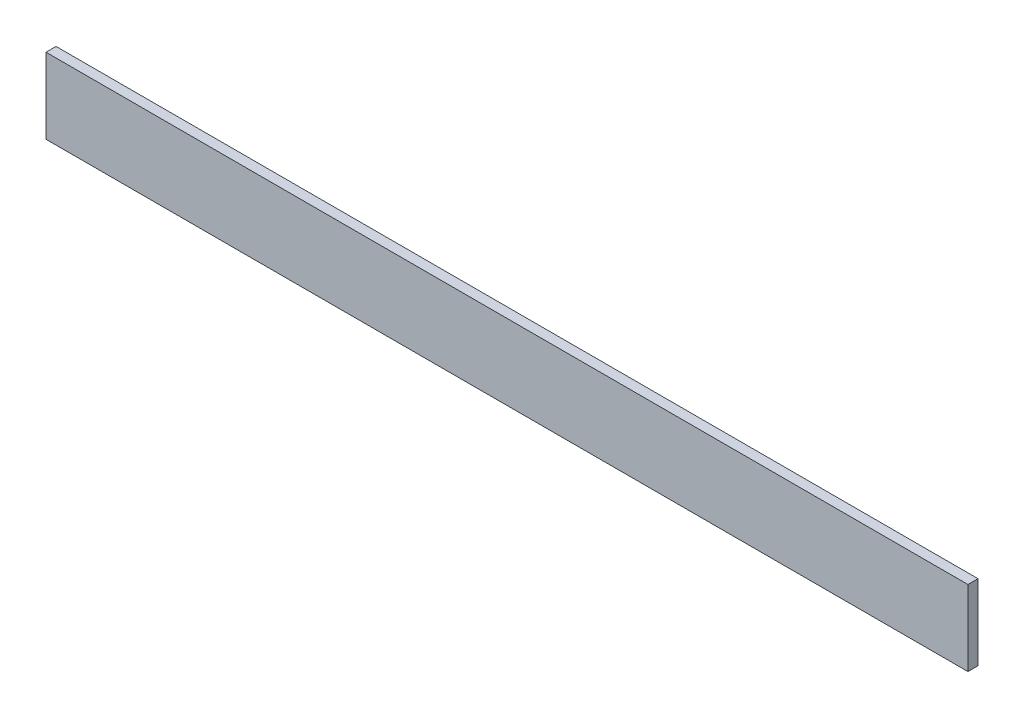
from build123d import *

# Parameters (mm, degrees)
SKETCH1_W           = 1100
SKETCH1_H           = 90
BOSS_EXTRUDE2_DEPTH = 12


with BuildPart() as part:
    # Sketch1 → Boss-Extrude2 (new body)
    with BuildSketch(Plane.XY):
        Rectangle(SKETCH1_W, SKETCH1_H)
    extrude(amount=BOSS_EXTRUDE2_DEPTH)


solid = part.part
